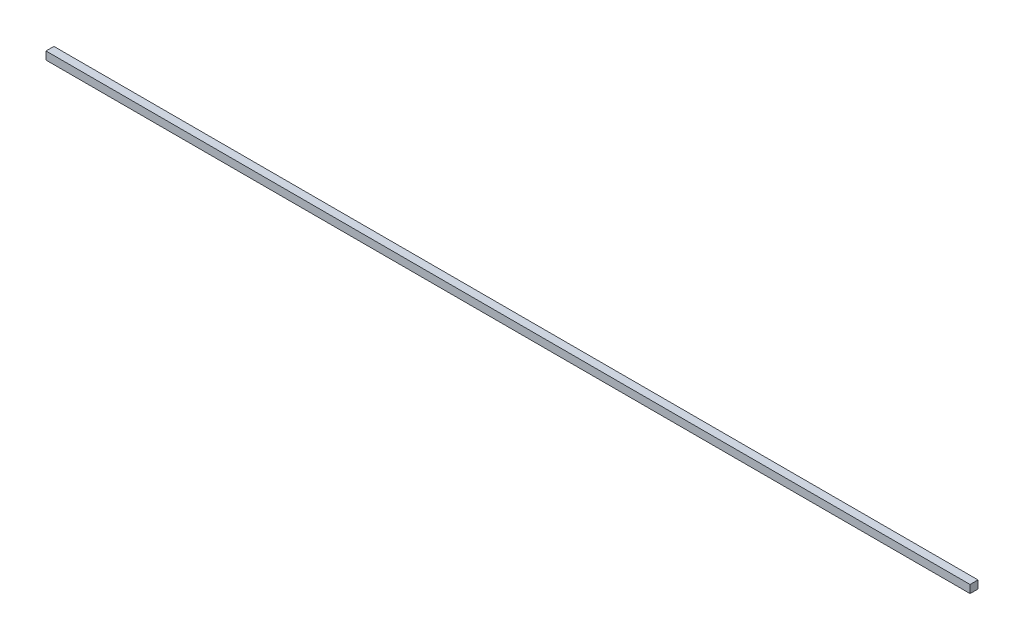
from build123d import *

# Parameters (mm, degrees)
ESQUISSE1_W      = 350
ESQUISSE1_H      = 3
EXTRUSION1_DEPTH = 3


with BuildPart() as part:
    # Esquisse1 → Extrusion1 (new body)
    with BuildSketch(Plane.XY):
        with Locations((175, 1.5)):
            Rectangle(ESQUISSE1_W, ESQUISSE1_H)
    extrude(amount=EXTRUSION1_DEPTH)


solid = part.part
